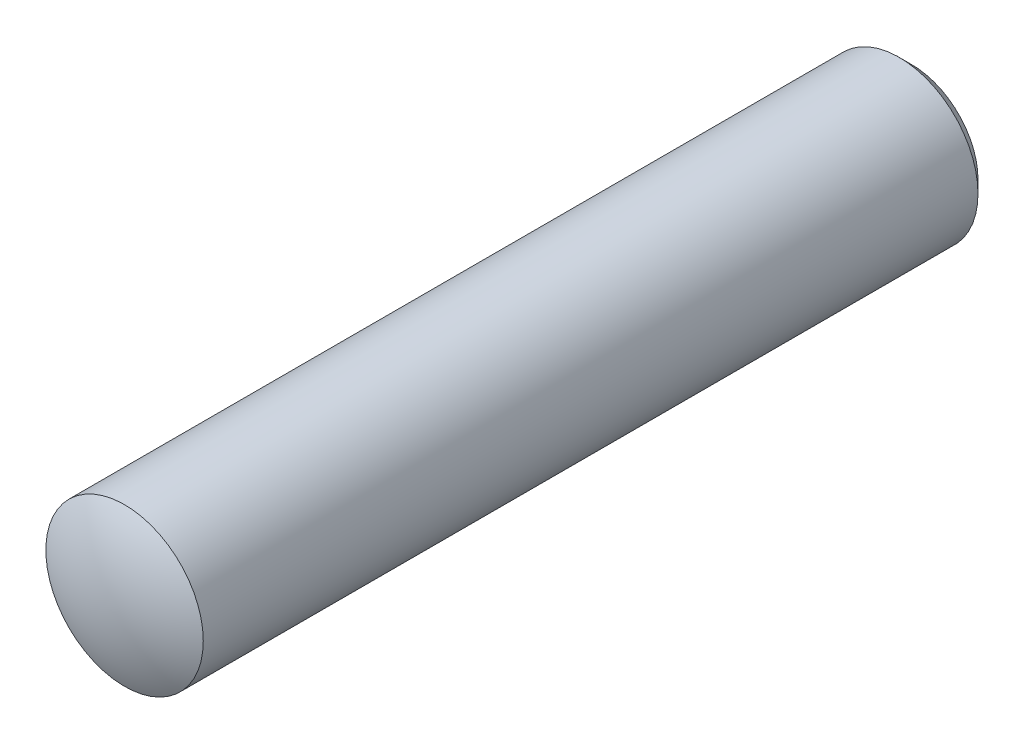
ISO-10303-21;
HEADER;
FILE_DESCRIPTION(('STEP AP214'),'2;1');
FILE_NAME('part.step','',(''),(''),'','','');
FILE_SCHEMA(('AUTOMOTIVE_DESIGN { 1 0 10303 214 1 1 1 1 }'));
ENDSEC;
DATA;
#1=APPLICATION_CONTEXT('core data for automotive mechanical design processes');
#2=APPLICATION_PROTOCOL_DEFINITION('international standard','automotive_design',2000,#1);
#3=PRODUCT_CONTEXT('',#1,'mechanical');
#4=PRODUCT('Part','Part','',(#3));
#5=PRODUCT_RELATED_PRODUCT_CATEGORY('part','',(#4));
#6=PRODUCT_DEFINITION_FORMATION('','',#4);
#7=PRODUCT_DEFINITION_CONTEXT('part definition',#1,'design');
#8=PRODUCT_DEFINITION('design','',#6,#7);
#9=PRODUCT_DEFINITION_SHAPE('','',#8);
#10=(LENGTH_UNIT() NAMED_UNIT(*) SI_UNIT(.MILLI.,.METRE.));
#11=(NAMED_UNIT(*) PLANE_ANGLE_UNIT() SI_UNIT($,.RADIAN.));
#12=(NAMED_UNIT(*) SI_UNIT($,.STERADIAN.) SOLID_ANGLE_UNIT());
#13=UNCERTAINTY_MEASURE_WITH_UNIT(LENGTH_MEASURE(1.E-05),#10,'distance_accuracy_value','');
#14=(GEOMETRIC_REPRESENTATION_CONTEXT(3) GLOBAL_UNCERTAINTY_ASSIGNED_CONTEXT((#13)) GLOBAL_UNIT_ASSIGNED_CONTEXT((#10,
#11,#12)) REPRESENTATION_CONTEXT('',''));
#15=CARTESIAN_POINT('',(0.,0.,0.));
#16=DIRECTION('',(0.,0.,1.));
#17=DIRECTION('',(1.,0.,0.));
#18=AXIS2_PLACEMENT_3D('',#15,#16,#17);
#19=CARTESIAN_POINT('',(0.,0.,-15.));
#20=DIRECTION('',(0.,0.,1.));
#21=DIRECTION('',(1.,0.,0.));
#22=AXIS2_PLACEMENT_3D('',#19,#20,#21);
#23=CYLINDRICAL_SURFACE('',#22,6.);
#24=CARTESIAN_POINT('',(0.,0.,-14.0528125));
#25=DIRECTION('',(0.,0.,1.));
#26=DIRECTION('',(1.,0.,0.));
#27=AXIS2_PLACEMENT_3D('',#24,#25,#26);
#28=CIRCLE('',#27,6.);
#29=CARTESIAN_POINT('',(6.00000000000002,0.,-14.0528125));
#30=VERTEX_POINT('',#29);
#31=EDGE_CURVE('E38',#30,#30,#28,.T.);
#32=ORIENTED_EDGE('',*,*,#31,.T.);
#33=EDGE_LOOP('',(#32));
#34=FACE_BOUND('',#33,.T.);
#35=CARTESIAN_POINT('',(0.,0.,45.));
#36=DIRECTION('',(0.,0.,1.));
#37=DIRECTION('',(1.,0.,0.));
#38=AXIS2_PLACEMENT_3D('',#35,#36,#37);
#39=CIRCLE('',#38,6.);
#40=CARTESIAN_POINT('',(6.00000000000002,0.,45.));
#41=VERTEX_POINT('',#40);
#42=EDGE_CURVE('E42',#41,#41,#39,.T.);
#43=ORIENTED_EDGE('',*,*,#42,.F.);
#44=EDGE_LOOP('',(#43));
#45=FACE_BOUND('',#44,.T.);
#46=ADVANCED_FACE('F31',(#34,#45),#23,.T.);
#47=CARTESIAN_POINT('',(0.,0.,-15.));
#48=DIRECTION('',(0.,0.,1.));
#49=DIRECTION('',(1.,0.,0.));
#50=AXIS2_PLACEMENT_3D('',#47,#48,#49);
#51=PLANE('',#50);
#52=CARTESIAN_POINT('',(0.,0.,-15.));
#53=DIRECTION('',(0.,0.,1.));
#54=DIRECTION('',(1.,0.,0.));
#55=AXIS2_PLACEMENT_3D('',#52,#53,#54);
#56=CIRCLE('',#55,5.0528125);
#57=CARTESIAN_POINT('',(5.05281250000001,0.,-15.));
#58=VERTEX_POINT('',#57);
#59=EDGE_CURVE('E10',#58,#58,#56,.F.);
#60=ORIENTED_EDGE('',*,*,#59,.T.);
#61=EDGE_LOOP('',(#60));
#62=FACE_BOUND('',#61,.T.);
#63=ADVANCED_FACE('F51',(#62),#51,.F.);
#64=CARTESIAN_POINT('',(0.,0.,33.75));
#65=DIRECTION('',(0.,0.,1.));
#66=DIRECTION('',(1.,0.,0.));
#67=AXIS2_PLACEMENT_3D('',#64,#65,#66);
#68=SPHERICAL_SURFACE('',#67,12.75);
#69=ORIENTED_EDGE('',*,*,#42,.T.);
#70=EDGE_LOOP('',(#69));
#71=FACE_BOUND('',#70,.T.);
#72=ADVANCED_FACE('F33',(#71),#68,.T.);
#73=CARTESIAN_POINT('',(0.,0.,-14.0528125));
#74=DIRECTION('',(0.,0.,1.));
#75=DIRECTION('',(1.,0.,0.));
#76=AXIS2_PLACEMENT_3D('',#73,#74,#75);
#77=CONICAL_SURFACE('',#76,6.,0.785398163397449);
#78=CARTESIAN_POINT('',(5.05281250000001,0.,-15.));
#79=CARTESIAN_POINT('',(5.06267903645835,0.,-14.9901334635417));
#80=CARTESIAN_POINT('',(5.07254557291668,0.,-14.9802669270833));
#81=CARTESIAN_POINT('',(5.09227864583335,0.,-14.9605338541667));
#82=CARTESIAN_POINT('',(5.10214518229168,0.,-14.9506673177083));
#83=CARTESIAN_POINT('',(5.12187825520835,0.,-14.9309342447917));
#84=CARTESIAN_POINT('',(5.13174479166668,0.,-14.9210677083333));
#85=CARTESIAN_POINT('',(5.15147786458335,0.,-14.9013346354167));
#86=CARTESIAN_POINT('',(5.16134440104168,0.,-14.8914680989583));
#87=CARTESIAN_POINT('',(5.18107747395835,0.,-14.8717350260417));
#88=CARTESIAN_POINT('',(5.19094401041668,0.,-14.8618684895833));
#89=CARTESIAN_POINT('',(5.21067708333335,0.,-14.8421354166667));
#90=CARTESIAN_POINT('',(5.22054361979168,0.,-14.8322688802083));
#91=CARTESIAN_POINT('',(5.24027669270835,0.,-14.8125358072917));
#92=CARTESIAN_POINT('',(5.25014322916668,0.,-14.8026692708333));
#93=CARTESIAN_POINT('',(5.26987630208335,0.,-14.7829361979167));
#94=CARTESIAN_POINT('',(5.27974283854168,0.,-14.7730696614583));
#95=CARTESIAN_POINT('',(5.29947591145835,0.,-14.7533365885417));
#96=CARTESIAN_POINT('',(5.30934244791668,0.,-14.7434700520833));
#97=CARTESIAN_POINT('',(5.32907552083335,0.,-14.7237369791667));
#98=CARTESIAN_POINT('',(5.33894205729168,0.,-14.7138704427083));
#99=CARTESIAN_POINT('',(5.35867513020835,0.,-14.6941373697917));
#100=CARTESIAN_POINT('',(5.36854166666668,0.,-14.6842708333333));
#101=CARTESIAN_POINT('',(5.38827473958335,0.,-14.6645377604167));
#102=CARTESIAN_POINT('',(5.39814127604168,0.,-14.6546712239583));
#103=CARTESIAN_POINT('',(5.41787434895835,0.,-14.6349381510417));
#104=CARTESIAN_POINT('',(5.42774088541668,0.,-14.6250716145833));
#105=CARTESIAN_POINT('',(5.44747395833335,0.,-14.6053385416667));
#106=CARTESIAN_POINT('',(5.45734049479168,0.,-14.5954720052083));
#107=CARTESIAN_POINT('',(5.47707356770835,0.,-14.5757389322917));
#108=CARTESIAN_POINT('',(5.48694010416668,0.,-14.5658723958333));
#109=CARTESIAN_POINT('',(5.50667317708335,0.,-14.5461393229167));
#110=CARTESIAN_POINT('',(5.51653971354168,0.,-14.5362727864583));
#111=CARTESIAN_POINT('',(5.53627278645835,0.,-14.5165397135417));
#112=CARTESIAN_POINT('',(5.54613932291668,0.,-14.5066731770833));
#113=CARTESIAN_POINT('',(5.56587239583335,0.,-14.4869401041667));
#114=CARTESIAN_POINT('',(5.57573893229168,0.,-14.4770735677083));
#115=CARTESIAN_POINT('',(5.59547200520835,0.,-14.4573404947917));
#116=CARTESIAN_POINT('',(5.60533854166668,0.,-14.4474739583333));
#117=CARTESIAN_POINT('',(5.62507161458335,0.,-14.4277408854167));
#118=CARTESIAN_POINT('',(5.63493815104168,0.,-14.4178743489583));
#119=CARTESIAN_POINT('',(5.65467122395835,0.,-14.3981412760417));
#120=CARTESIAN_POINT('',(5.66453776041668,0.,-14.3882747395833));
#121=CARTESIAN_POINT('',(5.68427083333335,0.,-14.3685416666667));
#122=CARTESIAN_POINT('',(5.69413736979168,0.,-14.3586751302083));
#123=CARTESIAN_POINT('',(5.71387044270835,0.,-14.3389420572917));
#124=CARTESIAN_POINT('',(5.72373697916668,0.,-14.3290755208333));
#125=CARTESIAN_POINT('',(5.74347005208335,0.,-14.3093424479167));
#126=CARTESIAN_POINT('',(5.75333658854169,0.,-14.2994759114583));
#127=CARTESIAN_POINT('',(5.77306966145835,0.,-14.2797428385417));
#128=CARTESIAN_POINT('',(5.78293619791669,0.,-14.2698763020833));
#129=CARTESIAN_POINT('',(5.80266927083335,0.,-14.2501432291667));
#130=CARTESIAN_POINT('',(5.81253580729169,0.,-14.2402766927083));
#131=CARTESIAN_POINT('',(5.83226888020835,0.,-14.2205436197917));
#132=CARTESIAN_POINT('',(5.84213541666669,0.,-14.2106770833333));
#133=CARTESIAN_POINT('',(5.86186848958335,0.,-14.1909440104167));
#134=CARTESIAN_POINT('',(5.87173502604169,0.,-14.1810774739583));
#135=CARTESIAN_POINT('',(5.89146809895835,0.,-14.1613444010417));
#136=CARTESIAN_POINT('',(5.90133463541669,0.,-14.1514778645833));
#137=CARTESIAN_POINT('',(5.92106770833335,0.,-14.1317447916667));
#138=CARTESIAN_POINT('',(5.93093424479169,0.,-14.1218782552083));
#139=CARTESIAN_POINT('',(5.95066731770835,0.,-14.1021451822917));
#140=CARTESIAN_POINT('',(5.96053385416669,0.,-14.0922786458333));
#141=CARTESIAN_POINT('',(5.98026692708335,0.,-14.0725455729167));
#142=CARTESIAN_POINT('',(5.99013346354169,0.,-14.0626790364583));
#143=CARTESIAN_POINT('',(6.00000000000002,0.,-14.0528125));
#144=B_SPLINE_CURVE_WITH_KNOTS('',3,(#78,#79,#80,#81,#82,#83,#84,#85,#86,#87,#88,#89,#90,#91,
#92,#93,#94,#95,#96,#97,#98,#99,#100,#101,#102,#103,#104,#105,#106,#107,#108,#109,#110,#111,
#112,#113,#114,#115,#116,#117,#118,#119,#120,#121,#122,#123,#124,#125,#126,#127,#128,#129,#130,
#131,#132,#133,#134,#135,#136,#137,#138,#139,#140,#141,#142,#143),.UNSPECIFIED.,.F.,.F.,(4,2,2,
2,2,2,2,2,2,2,2,2,2,2,2,2,2,2,2,2,2,2,2,2,2,2,2,2,2,2,2,2,4),(0.,0.0418601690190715,
0.0837203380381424,0.125580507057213,0.167440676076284,0.209300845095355,0.251161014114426,
0.293021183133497,0.334881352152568,0.376741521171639,0.41860169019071,0.460461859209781,
0.502322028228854,0.544182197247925,0.586042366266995,0.627902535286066,0.669762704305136,
0.711622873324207,0.753483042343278,0.795343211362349,0.83720338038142,0.879063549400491,
0.920923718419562,0.962783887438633,1.00464405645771,1.04650422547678,1.08836439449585,
1.13022456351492,1.17208473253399,1.21394490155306,1.25580507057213,1.2976652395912,
1.33952540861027),.UNSPECIFIED.);
#145=EDGE_CURVE('BSEAM57',#58,#30,#144,.T.);
#146=ORIENTED_EDGE('',*,*,#59,.F.);
#147=ORIENTED_EDGE('',*,*,#31,.F.);
#148=ORIENTED_EDGE('',*,*,#145,.T.);
#149=ORIENTED_EDGE('',*,*,#145,.F.);
#150=EDGE_LOOP('',(#146,#148,#147,#149));
#151=FACE_BOUND('',#150,.T.);
#152=ADVANCED_FACE('F57',(#151),#77,.T.);
#153=CLOSED_SHELL('',(#46,#63,#72,#152));
#154=MANIFOLD_SOLID_BREP('B2',#153);
#155=ADVANCED_BREP_SHAPE_REPRESENTATION('',(#18,#154),#14);
#156=SHAPE_DEFINITION_REPRESENTATION(#9,#155);
ENDSEC;
END-ISO-10303-21;
